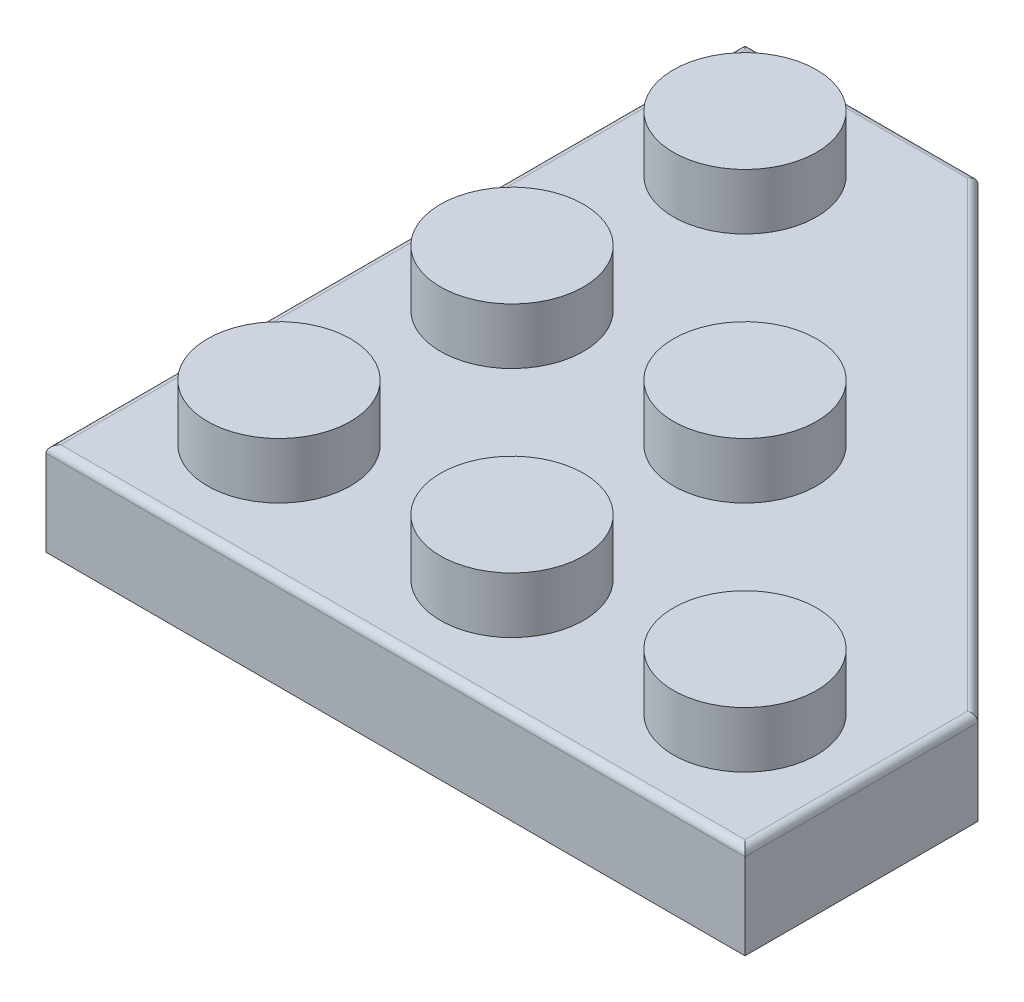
from build123d import *

# Parameters (mm, degrees)
SKETCH1_W                = 23.8125
SKETCH1_H                = 23.8125
BASE_EXTRUDE_DEPTH       = 3.175
SKETCH2_R                = 2.4384
BOSS_EXTRUDE1_DEPTH      = 1.905
LPATTERN4_COUNT          = 3
LPATTERN4_PITCH          = 7.9375
LPATTERN4_COUNT_DIR2     = 3
LPATTERN4_PITCH_DIR2     = 7.9375
CUT_EXTRUDE1_DEPTH       = 18.134707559
SHELL1_T                 = -1.5875
SKETCH3_R                = 3.2004
SKETCH3_R_2              = 2.4384
INSDOT_DEPTH             = 1.5875
SKETCH5_R                = 3.2004
SKETCH5_R_2              = 2.4384
BOSS_EXTRUDE_THIN1_DEPTH = 1.5875
SKETCH6_R                = 3.2004
SKETCH6_R_2              = 2.4384
BOSS_EXTRUDE_THIN2_DEPTH = 1.5875
CUT_EXTRUDE2_START       = -1.5875
CUT_EXTRUDE2_DEPTH       = 1.5875
BOSS_EXTRUDE_THIN3_REACH = 19.588
FILLET1_R                = 0.254


with BuildPart() as part:
    # Sketch1 → Base-Extrude (new body)
    with BuildSketch(Plane(origin=(0, 0, 0), x_dir=(1, 0, 0), z_dir=(0, 1, 0))):
        Rectangle(SKETCH1_W, SKETCH1_H)
    extrude(amount=BASE_EXTRUDE_DEPTH)

    # Sketch2 → Boss-Extrude1 (add)
    with BuildSketch(Plane(origin=(0, 3.175, 0), x_dir=(-1, 0, 0), z_dir=(0, 1, 0))):
        with Locations(Location((7.9375, 7.9375, 0), (0, 0, 270))):
            Circle(SKETCH2_R)
    boss_extrude1 = extrude(amount=BOSS_EXTRUDE1_DEPTH)

    # LPattern4: Boss-Extrude1 3 × 3, 3 skipped
    with Locations(*[(i * LPATTERN4_PITCH, 0, -j * LPATTERN4_PITCH_DIR2) for i in range(LPATTERN4_COUNT) for j in range(LPATTERN4_COUNT_DIR2) if (i, j) not in ((0, 0), (1, 2), (2, 1), (2, 2))]):
        add(boss_extrude1)

    # Sketch4 → Cut-Extrude1 (cut, through all)
    with BuildSketch(Plane(origin=(0, 3.175, 0), x_dir=(-1, 0, 0), z_dir=(0, 1, 0))):
        Polygon((-11.90625, 3.96875), (3.96875, -11.90625), (-11.90625, -11.90625), align=None)
    extrude(amount=-CUT_EXTRUDE1_DEPTH, mode=Mode.SUBTRACT)

    # Shell1
    shell1_openings = [part.faces().sort_by_distance(p)[0] for p in [
        (-1.889880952, 0, 1.889880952),
    ]]
    offset(amount=SHELL1_T, openings=shell1_openings, kind=Kind.INTERSECTION)

    # Sketch3 → InsDot (add)
    with BuildSketch(Plane.XZ.offset(-1.5875)):
        with Locations((-3.96875, -3.96875)):
            Circle(SKETCH3_R)
        with Locations((-3.96875, -3.96875)):
            Circle(SKETCH3_R_2, mode=Mode.SUBTRACT)
    extrude(amount=INSDOT_DEPTH)

    # Sketch5 → Boss-Extrude-Thin1 (add)
    with BuildSketch(Plane(origin=(-0.918447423, 1.5875, 6.872038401), x_dir=(1, 0, 0), z_dir=(0, -1, 0))):
        with Locations((-3.050302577, -2.903288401)):
            Circle(SKETCH5_R)
        with Locations((-3.050302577, -2.903288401)):
            Circle(SKETCH5_R_2, mode=Mode.SUBTRACT)
    extrude(amount=BOSS_EXTRUDE_THIN1_DEPTH)

    # Sketch6 → Boss-Extrude-Thin2 (add)
    with BuildSketch(Plane(origin=(7.701488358, 1.5875, 8.898864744), x_dir=(1, 0, 0), z_dir=(0, -1, 0))):
        with Locations((-3.732738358, -4.930114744)):
            Circle(SKETCH6_R)
        with Locations((-3.732738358, -4.930114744)):
            Circle(SKETCH6_R_2, mode=Mode.SUBTRACT)
    extrude(amount=BOSS_EXTRUDE_THIN2_DEPTH)

    # Sketch7 → Cut-Extrude2 (cut)
    with BuildSketch(Plane.XZ.offset(CUT_EXTRUDE2_START)):
        Polygon((5.540294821, -0.152141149), (6.662826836, -1.274673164), (10.075324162, 2.137824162), (8.952792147, 3.260356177), align=None)
        Polygon((-3.260356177, -8.952792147), (0.152141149, -5.540294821), (1.274673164, -6.662826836), (-2.137824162, -10.075324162), align=None)
    extrude(amount=CUT_EXTRUDE2_DEPTH, mode=Mode.SUBTRACT)

    # Sketch8 → Boss-Extrude-Thin3 (add, up to next)
    with BuildSketch(Plane.XZ, mode=Mode.PRIVATE) as boss_extrude_thin3_sk1:
        Polygon((3.241680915, -2.534574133), (2.343655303, -1.636548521), (1.636548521, -2.343655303), (2.534574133, -3.241680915), align=None)
    boss_extrude_thin3_tool1 = extrude(boss_extrude_thin3_sk1.sketch, amount=-BOSS_EXTRUDE_THIN3_REACH, mode=Mode.PRIVATE) - part.part
    add(boss_extrude_thin3_tool1.solids().sort_by_distance((2.439115, 0, -2.439115))[0])

    # Fillet1
    fillet1_edges = [part.edges().sort_by_distance(p)[0] for p in [
        (11.90625, 3.175, 7.9375),
        (-7.9375, 3.175, -11.90625),
        (3.96875, 3.175, -3.96875),
        (-11.90625, 3.175, 0),
        (0, 3.175, 11.90625),
    ]]
    fillet(fillet1_edges, radius=FILLET1_R)


solid = part.part
